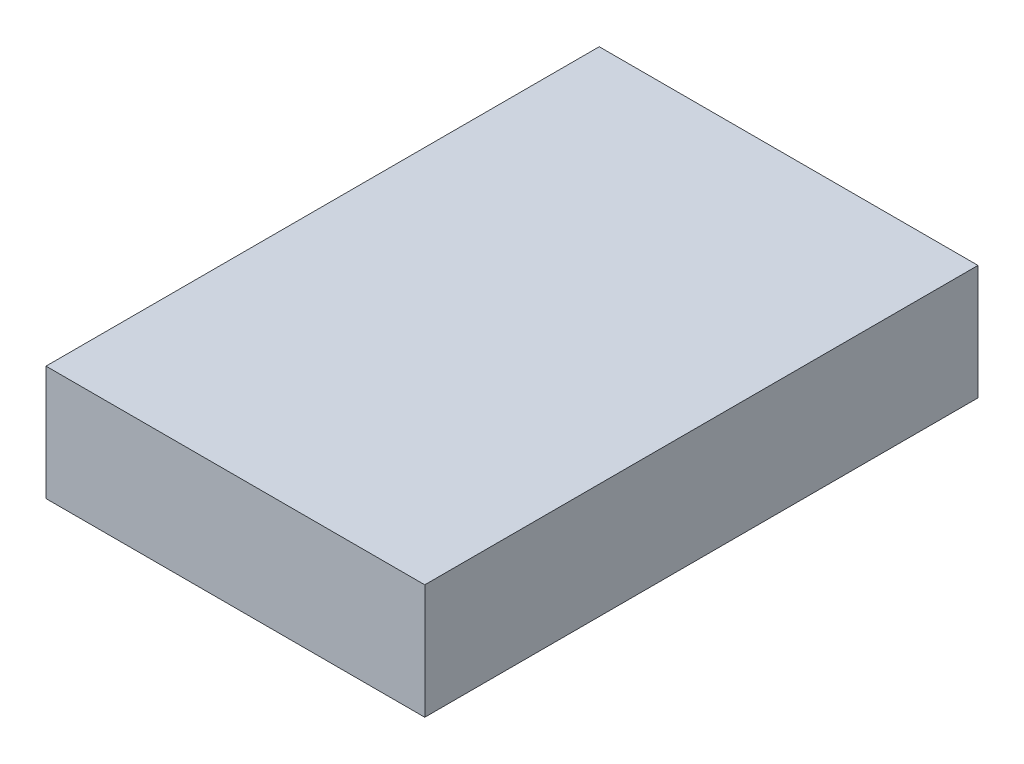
from build123d import *

# Parameters (mm, degrees)
SKETCH1_W           = 120.5
SKETCH1_H           = 36.5
BOSS_EXTRUDE1_DEPTH = 176
SKETCH2_R           = 3
CUT_EXTRUDE1_DEPTH  = 10


with BuildPart() as part:
    # Sketch1 → Boss-Extrude1 (new body)
    with BuildSketch(Plane.XY):
        with Locations((-37.322202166, 3.030685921)):
            Rectangle(SKETCH1_W, SKETCH1_H)
    extrude(amount=BOSS_EXTRUDE1_DEPTH)

    # Sketch2 → Cut-Extrude1 (cut)
    with BuildSketch(Plane(origin=(0, 0, 0), x_dir=(-1, 0, 0), z_dir=(0, 0, -1))):
        with Locations((72.572202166, -5.219314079)):
            Circle(SKETCH2_R)
    extrude(amount=-CUT_EXTRUDE1_DEPTH, mode=Mode.SUBTRACT)


solid = part.part
